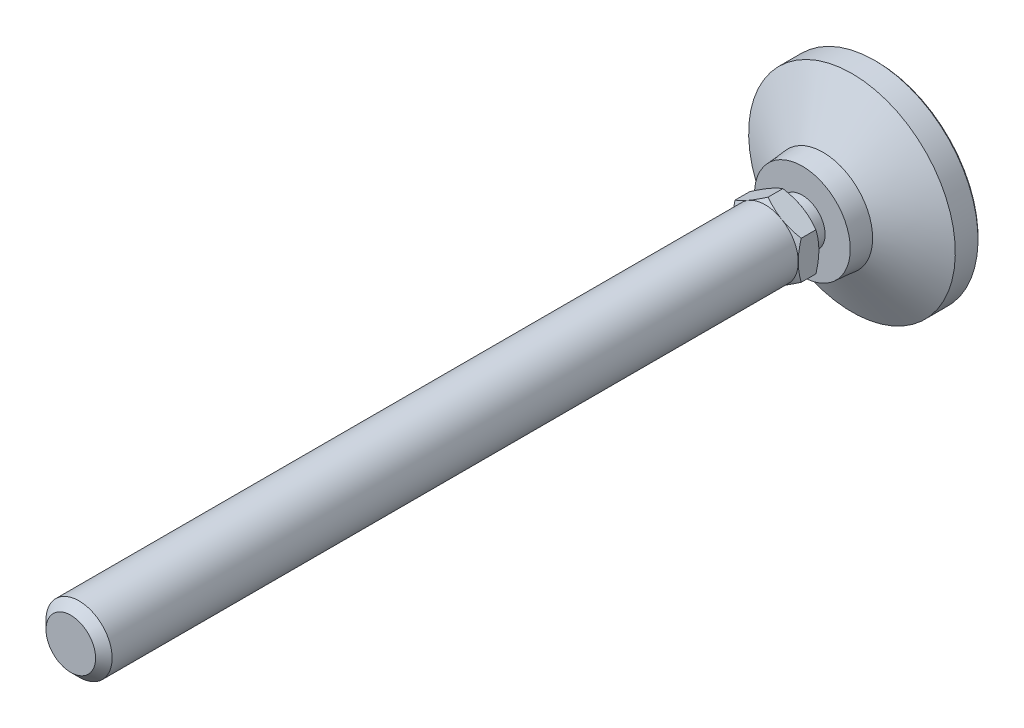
ISO-10303-21;
HEADER;
FILE_DESCRIPTION(('STEP AP214'),'2;1');
FILE_NAME('part.step','',(''),(''),'','','');
FILE_SCHEMA(('AUTOMOTIVE_DESIGN { 1 0 10303 214 1 1 1 1 }'));
ENDSEC;
DATA;
#1=APPLICATION_CONTEXT('core data for automotive mechanical design processes');
#2=APPLICATION_PROTOCOL_DEFINITION('international standard','automotive_design',2000,#1);
#3=PRODUCT_CONTEXT('',#1,'mechanical');
#4=PRODUCT('Part','Part','',(#3));
#5=PRODUCT_RELATED_PRODUCT_CATEGORY('part','',(#4));
#6=PRODUCT_DEFINITION_FORMATION('','',#4);
#7=PRODUCT_DEFINITION_CONTEXT('part definition',#1,'design');
#8=PRODUCT_DEFINITION('design','',#6,#7);
#9=PRODUCT_DEFINITION_SHAPE('','',#8);
#10=(LENGTH_UNIT() NAMED_UNIT(*) SI_UNIT(.MILLI.,.METRE.));
#11=(NAMED_UNIT(*) PLANE_ANGLE_UNIT() SI_UNIT($,.RADIAN.));
#12=(NAMED_UNIT(*) SI_UNIT($,.STERADIAN.) SOLID_ANGLE_UNIT());
#13=UNCERTAINTY_MEASURE_WITH_UNIT(LENGTH_MEASURE(1.E-05),#10,'distance_accuracy_value','');
#14=(GEOMETRIC_REPRESENTATION_CONTEXT(3) GLOBAL_UNCERTAINTY_ASSIGNED_CONTEXT((#13)) GLOBAL_UNIT_ASSIGNED_CONTEXT((#10,
#11,#12)) REPRESENTATION_CONTEXT('',''));
#15=CARTESIAN_POINT('',(0.,0.,0.));
#16=DIRECTION('',(0.,0.,1.));
#17=DIRECTION('',(1.,0.,0.));
#18=AXIS2_PLACEMENT_3D('',#15,#16,#17);
#19=CARTESIAN_POINT('',(0.,-5.50000000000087,21.9999999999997));
#20=DIRECTION('',(0.,0.,-1.));
#21=DIRECTION('',(0.,1.,0.));
#22=AXIS2_PLACEMENT_3D('',#19,#20,#21);
#23=PLANE('',#22);
#24=CARTESIAN_POINT('',(0.,0.,21.9999999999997));
#25=DIRECTION('',(0.,0.,-1.));
#26=DIRECTION('',(0.,1.,0.));
#27=AXIS2_PLACEMENT_3D('',#24,#25,#26);
#28=CIRCLE('',#27,8.00000000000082);
#29=CARTESIAN_POINT('',(-4.00000000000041,6.92820323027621,21.9999999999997));
#30=VERTEX_POINT('',#29);
#31=CARTESIAN_POINT('',(-8.00000000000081,0.,21.9999999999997));
#32=VERTEX_POINT('',#31);
#33=EDGE_CURVE('E9',#30,#32,#28,.F.);
#34=ORIENTED_EDGE('',*,*,#33,.F.);
#35=CARTESIAN_POINT('',(4.,6.92820323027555,21.9999999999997));
#36=VERTEX_POINT('',#35);
#37=EDGE_CURVE('E18',#36,#30,#28,.F.);
#38=ORIENTED_EDGE('',*,*,#37,.F.);
#39=CARTESIAN_POINT('',(8.00000000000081,0.,21.9999999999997));
#40=VERTEX_POINT('',#39);
#41=EDGE_CURVE('E125',#40,#36,#28,.F.);
#42=ORIENTED_EDGE('',*,*,#41,.F.);
#43=CARTESIAN_POINT('',(0.,0.,21.9999999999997));
#44=DIRECTION('',(0.,0.,1.));
#45=DIRECTION('',(0.,-1.,0.));
#46=AXIS2_PLACEMENT_3D('',#43,#44,#45);
#47=CIRCLE('',#46,8.00000000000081);
#48=CARTESIAN_POINT('',(4.00000000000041,-6.92820323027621,21.9999999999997));
#49=VERTEX_POINT('',#48);
#50=EDGE_CURVE('E572',#49,#40,#47,.T.);
#51=ORIENTED_EDGE('',*,*,#50,.F.);
#52=CARTESIAN_POINT('',(-4.00000000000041,-6.92820323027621,21.9999999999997));
#53=VERTEX_POINT('',#52);
#54=EDGE_CURVE('E574',#53,#49,#28,.F.);
#55=ORIENTED_EDGE('',*,*,#54,.F.);
#56=EDGE_CURVE('E23',#32,#53,#28,.F.);
#57=ORIENTED_EDGE('',*,*,#56,.F.);
#58=EDGE_LOOP('',(#34,#38,#42,#51,#55,#57));
#59=FACE_BOUND('',#58,.T.);
#60=CARTESIAN_POINT('',(0.,0.,21.9999999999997));
#61=DIRECTION('',(0.,0.,-1.));
#62=DIRECTION('',(0.,1.,0.));
#63=AXIS2_PLACEMENT_3D('',#60,#61,#62);
#64=CIRCLE('',#63,5.50000000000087);
#65=CARTESIAN_POINT('',(0.,5.50000000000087,21.9999999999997));
#66=VERTEX_POINT('',#65);
#67=EDGE_CURVE('E232',#66,#66,#64,.T.);
#68=ORIENTED_EDGE('',*,*,#67,.F.);
#69=EDGE_LOOP('',(#68));
#70=FACE_BOUND('',#69,.T.);
#71=ADVANCED_FACE('F14',(#59,#70),#23,.T.);
#72=CARTESIAN_POINT('',(0.,0.,-1.));
#73=DIRECTION('',(0.,0.,-1.));
#74=DIRECTION('',(0.,1.,0.));
#75=AXIS2_PLACEMENT_3D('',#72,#73,#74);
#76=CYLINDRICAL_SURFACE('',#75,5.50000000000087);
#77=CARTESIAN_POINT('',(0.,0.,18.));
#78=DIRECTION('',(0.,0.,-1.));
#79=DIRECTION('',(0.,1.,0.));
#80=AXIS2_PLACEMENT_3D('',#77,#78,#79);
#81=CIRCLE('',#80,5.50000000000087);
#82=CARTESIAN_POINT('',(0.,5.50000000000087,18.));
#83=VERTEX_POINT('',#82);
#84=EDGE_CURVE('E235',#83,#83,#81,.T.);
#85=ORIENTED_EDGE('',*,*,#84,.F.);
#86=EDGE_LOOP('',(#85));
#87=FACE_BOUND('',#86,.T.);
#88=ORIENTED_EDGE('',*,*,#67,.T.);
#89=EDGE_LOOP('',(#88));
#90=FACE_BOUND('',#89,.T.);
#91=ADVANCED_FACE('F289',(#87,#90),#76,.T.);
#92=CARTESIAN_POINT('',(0.,-5.50000000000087,18.));
#93=DIRECTION('',(0.,0.,1.));
#94=DIRECTION('',(0.,-1.,0.));
#95=AXIS2_PLACEMENT_3D('',#92,#93,#94);
#96=PLANE('',#95);
#97=ORIENTED_EDGE('',*,*,#84,.T.);
#98=EDGE_LOOP('',(#97));
#99=FACE_BOUND('',#98,.T.);
#100=CARTESIAN_POINT('',(0.,0.,18.));
#101=DIRECTION('',(0.,0.,1.));
#102=DIRECTION('',(0.,-1.,0.));
#103=AXIS2_PLACEMENT_3D('',#100,#101,#102);
#104=CIRCLE('',#103,11.5833333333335);
#105=CARTESIAN_POINT('',(0.,-11.5833333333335,18.));
#106=VERTEX_POINT('',#105);
#107=EDGE_CURVE('E238',#106,#106,#104,.T.);
#108=ORIENTED_EDGE('',*,*,#107,.T.);
#109=EDGE_LOOP('',(#108));
#110=FACE_BOUND('',#109,.T.);
#111=ADVANCED_FACE('F281',(#99,#110),#96,.T.);
#112=CARTESIAN_POINT('',(0.,0.,0.));
#113=DIRECTION('',(0.,0.,-1.));
#114=DIRECTION('',(0.,1.,0.));
#115=AXIS2_PLACEMENT_3D('',#112,#113,#114);
#116=PLANE('',#115);
#117=CARTESIAN_POINT('',(0.,0.,0.));
#118=DIRECTION('',(0.,0.,-1.));
#119=DIRECTION('',(0.,1.,0.));
#120=AXIS2_PLACEMENT_3D('',#117,#118,#119);
#121=CIRCLE('',#120,24.5);
#122=CARTESIAN_POINT('',(0.,24.5,0.));
#123=VERTEX_POINT('',#122);
#124=EDGE_CURVE('E267',#123,#123,#121,.T.);
#125=ORIENTED_EDGE('',*,*,#124,.T.);
#126=EDGE_LOOP('',(#125));
#127=FACE_BOUND('',#126,.T.);
#128=ADVANCED_FACE('F199',(#127),#116,.T.);
#129=CARTESIAN_POINT('',(0.,0.,-1.));
#130=DIRECTION('',(0.,0.,-1.));
#131=DIRECTION('',(0.,1.,0.));
#132=AXIS2_PLACEMENT_3D('',#129,#130,#131);
#133=CYLINDRICAL_SURFACE('',#132,25.);
#134=CARTESIAN_POINT('',(0.,0.,0.500000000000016));
#135=DIRECTION('',(0.,0.,-1.));
#136=DIRECTION('',(0.,1.,0.));
#137=AXIS2_PLACEMENT_3D('',#134,#135,#136);
#138=CIRCLE('',#137,25.);
#139=CARTESIAN_POINT('',(0.,25.,0.500000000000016));
#140=VERTEX_POINT('',#139);
#141=EDGE_CURVE('E126',#140,#140,#138,.F.);
#142=ORIENTED_EDGE('',*,*,#141,.T.);
#143=EDGE_LOOP('',(#142));
#144=FACE_BOUND('',#143,.T.);
#145=CARTESIAN_POINT('',(0.,0.,5.9999999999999));
#146=DIRECTION('',(0.,0.,-1.));
#147=DIRECTION('',(0.,1.,0.));
#148=AXIS2_PLACEMENT_3D('',#145,#146,#147);
#149=CIRCLE('',#148,25.);
#150=CARTESIAN_POINT('',(0.,25.,5.9999999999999));
#151=VERTEX_POINT('',#150);
#152=EDGE_CURVE('E241',#151,#151,#149,.T.);
#153=ORIENTED_EDGE('',*,*,#152,.T.);
#154=EDGE_LOOP('',(#153));
#155=FACE_BOUND('',#154,.T.);
#156=ADVANCED_FACE('F272',(#144,#155),#133,.T.);
#157=CARTESIAN_POINT('',(0.,0.,13.));
#158=DIRECTION('',(0.,0.,-1.));
#159=DIRECTION('',(0.,1.,0.));
#160=AXIS2_PLACEMENT_3D('',#157,#158,#159);
#161=CONICAL_SURFACE('',#160,12.0000000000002,1.07685495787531);
#162=ORIENTED_EDGE('',*,*,#152,.F.);
#163=EDGE_LOOP('',(#162));
#164=FACE_BOUND('',#163,.T.);
#165=CARTESIAN_POINT('',(0.,0.,13.));
#166=DIRECTION('',(0.,0.,-1.));
#167=DIRECTION('',(0.,1.,0.));
#168=AXIS2_PLACEMENT_3D('',#165,#166,#167);
#169=CIRCLE('',#168,12.0000000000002);
#170=CARTESIAN_POINT('',(0.,12.0000000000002,13.));
#171=VERTEX_POINT('',#170);
#172=EDGE_CURVE('E257',#171,#171,#169,.T.);
#173=ORIENTED_EDGE('',*,*,#172,.T.);
#174=EDGE_LOOP('',(#173));
#175=FACE_BOUND('',#174,.T.);
#176=ADVANCED_FACE('F288',(#164,#175),#161,.T.);
#177=CARTESIAN_POINT('',(0.,0.,19.));
#178=DIRECTION('',(0.,0.,-1.));
#179=DIRECTION('',(0.,1.,0.));
#180=AXIS2_PLACEMENT_3D('',#177,#178,#179);
#181=CONICAL_SURFACE('',#180,11.5000000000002,0.0831412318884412);
#182=ORIENTED_EDGE('',*,*,#172,.F.);
#183=EDGE_LOOP('',(#182));
#184=FACE_BOUND('',#183,.T.);
#185=ORIENTED_EDGE('',*,*,#107,.F.);
#186=EDGE_LOOP('',(#185));
#187=FACE_BOUND('',#186,.T.);
#188=ADVANCED_FACE('F277',(#184,#187),#181,.T.);
#189=CARTESIAN_POINT('',(0.,0.,0.));
#190=DIRECTION('',(0.,0.,1.));
#191=DIRECTION('',(0.,-1.,0.));
#192=AXIS2_PLACEMENT_3D('',#189,#190,#191);
#193=CONICAL_SURFACE('',#192,24.5,0.785398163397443);
#194=ORIENTED_EDGE('',*,*,#141,.F.);
#195=EDGE_LOOP('',(#194));
#196=FACE_BOUND('',#195,.T.);
#197=ORIENTED_EDGE('',*,*,#124,.F.);
#198=EDGE_LOOP('',(#197));
#199=FACE_BOUND('',#198,.T.);
#200=ADVANCED_FACE('F16',(#196,#199),#193,.T.);
#201=CARTESIAN_POINT('',(0.,0.,21.9999999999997));
#202=DIRECTION('',(0.,0.,1.));
#203=DIRECTION('',(0.,-1.,0.));
#204=AXIS2_PLACEMENT_3D('',#201,#202,#203);
#205=CONICAL_SURFACE('',#204,8.00000000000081,1.0471975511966);
#206=CARTESIAN_POINT('',(-8.0002,4.61868668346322,22.7145978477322));
#207=CARTESIAN_POINT('',(-7.8243512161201,4.72021302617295,22.6559907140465));
#208=CARTESIAN_POINT('',(-7.64784680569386,4.8221178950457,22.6000434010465));
#209=CARTESIAN_POINT('',(-7.29340453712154,5.02675523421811,22.4942010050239));
#210=CARTESIAN_POINT('',(-7.11546609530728,5.12948804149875,22.4443085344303));
#211=CARTESIAN_POINT('',(-6.57880176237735,5.43933133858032,22.3046927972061));
#212=CARTESIAN_POINT('',(-6.21795741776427,5.64766491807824,22.2252811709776));
#213=CARTESIAN_POINT('',(-5.67796082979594,5.95943209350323,22.1321616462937));
#214=CARTESIAN_POINT('',(-5.50042181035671,6.06193429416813,22.1056345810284));
#215=CARTESIAN_POINT('',(-5.14454088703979,6.26740224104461,22.0611531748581));
#216=CARTESIAN_POINT('',(-4.96619905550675,6.37036794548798,22.0431980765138));
#217=CARTESIAN_POINT('',(-4.6092083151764,6.57647664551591,22.0163156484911));
#218=CARTESIAN_POINT('',(-4.43055998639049,6.67961930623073,22.0073780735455));
#219=CARTESIAN_POINT('',(-4.07309829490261,6.88599991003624,21.9987223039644));
#220=CARTESIAN_POINT('',(-3.89428493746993,6.9892378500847,21.9990038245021));
#221=CARTESIAN_POINT('',(-3.55998663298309,7.18224506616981,22.008145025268));
#222=CARTESIAN_POINT('',(-3.40447809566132,7.27202796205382,22.0158896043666));
#223=CARTESIAN_POINT('',(-3.09382523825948,7.45138347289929,22.0382011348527));
#224=CARTESIAN_POINT('',(-2.93868094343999,7.54095607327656,22.0527685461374));
#225=CARTESIAN_POINT('',(-2.47384868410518,7.80932710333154,22.1063606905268));
#226=CARTESIAN_POINT('',(-2.16498351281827,7.98765049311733,22.1552686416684));
#227=CARTESIAN_POINT('',(-1.54397677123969,8.3461889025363,22.2775394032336));
#228=CARTESIAN_POINT('',(-1.23191445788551,8.52635816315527,22.3514205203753));
#229=CARTESIAN_POINT('',(-0.61244351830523,8.8840098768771,22.5191001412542));
#230=CARTESIAN_POINT('',(-0.305026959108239,9.06149691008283,22.6128592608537));
#231=CARTESIAN_POINT('',(0.000200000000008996,9.23771977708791,22.7145978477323));
#232=B_SPLINE_CURVE_WITH_KNOTS('',3,(#206,#207,#208,#209,#210,#211,#212,#213,#214,#215,#216,
#217,#218,#219,#220,#221,#222,#223,#224,#225,#226,#227,#228,#229,#230,#231),.UNSPECIFIED.,.F.,
.F.,(4,2,2,2,2,2,2,2,2,2,2,2,4),(0.,0.633973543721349,1.26821965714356,2.53934712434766,
3.15934343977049,3.77928496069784,4.39852133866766,5.01773858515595,5.55680239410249,
6.09590254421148,7.17487077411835,8.27776850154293,9.37850115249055),.UNSPECIFIED.);
#233=CARTESIAN_POINT('',(0.,9.23760430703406,22.7145311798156));
#234=VERTEX_POINT('',#233);
#235=EDGE_CURVE('E115',#30,#234,#232,.T.);
#236=ORIENTED_EDGE('',*,*,#235,.T.);
#237=CARTESIAN_POINT('',(-0.000199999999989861,9.2377197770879,22.7145978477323));
#238=CARTESIAN_POINT('',(0.175648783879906,9.13619343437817,22.6559907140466));
#239=CARTESIAN_POINT('',(0.352153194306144,9.03428856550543,22.6000434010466));
#240=CARTESIAN_POINT('',(0.70659546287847,8.82965122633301,22.4942010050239));
#241=CARTESIAN_POINT('',(0.884533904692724,8.72691841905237,22.4443085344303));
#242=CARTESIAN_POINT('',(1.42119823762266,8.4170751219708,22.3046927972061));
#243=CARTESIAN_POINT('',(1.78204258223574,8.20874154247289,22.2252811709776));
#244=CARTESIAN_POINT('',(2.32203917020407,7.89697436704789,22.1321616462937));
#245=CARTESIAN_POINT('',(2.49957818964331,7.79447216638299,22.1056345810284));
#246=CARTESIAN_POINT('',(2.85545911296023,7.58900421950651,22.0611531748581));
#247=CARTESIAN_POINT('',(3.03380094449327,7.48603851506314,22.0431980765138));
#248=CARTESIAN_POINT('',(3.39079168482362,7.27992981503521,22.0163156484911));
#249=CARTESIAN_POINT('',(3.56944001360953,7.17678715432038,22.0073780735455));
#250=CARTESIAN_POINT('',(3.92690170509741,6.97040655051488,21.9987223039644));
#251=CARTESIAN_POINT('',(4.1057150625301,6.86716861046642,21.9990038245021));
#252=CARTESIAN_POINT('',(4.44001336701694,6.67416139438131,22.008145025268));
#253=CARTESIAN_POINT('',(4.5955219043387,6.5843784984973,22.0158896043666));
#254=CARTESIAN_POINT('',(4.90617476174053,6.40502298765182,22.0382011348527));
#255=CARTESIAN_POINT('',(5.06131905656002,6.31545038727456,22.0527685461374));
#256=CARTESIAN_POINT('',(5.52615131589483,6.04707935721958,22.1063606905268));
#257=CARTESIAN_POINT('',(5.83501648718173,5.86875596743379,22.1552686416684));
#258=CARTESIAN_POINT('',(6.4560232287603,5.51021755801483,22.2775394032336));
#259=CARTESIAN_POINT('',(6.76808554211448,5.33004829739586,22.3514205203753));
#260=CARTESIAN_POINT('',(7.38755648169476,4.97239658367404,22.5191001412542));
#261=CARTESIAN_POINT('',(7.69497304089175,4.79490955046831,22.6128592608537));
#262=CARTESIAN_POINT('',(8.0002,4.61868668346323,22.7145978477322));
#263=B_SPLINE_CURVE_WITH_KNOTS('',3,(#237,#238,#239,#240,#241,#242,#243,#244,#245,#246,#247,
#248,#249,#250,#251,#252,#253,#254,#255,#256,#257,#258,#259,#260,#261,#262),.UNSPECIFIED.,.F.,
.F.,(4,2,2,2,2,2,2,2,2,2,2,2,4),(0.,0.633973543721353,1.26821965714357,2.53934712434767,
3.15934343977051,3.77928496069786,4.39852133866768,5.01773858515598,5.55680239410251,
6.09590254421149,7.17487077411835,8.27776850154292,9.37850115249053),.UNSPECIFIED.);
#264=EDGE_CURVE('E121',#234,#36,#263,.T.);
#265=ORIENTED_EDGE('',*,*,#264,.T.);
#266=ORIENTED_EDGE('',*,*,#37,.T.);
#267=EDGE_LOOP('',(#236,#265,#266));
#268=FACE_BOUND('',#267,.T.);
#269=ADVANCED_FACE('F119',(#268),#205,.T.);
#270=CARTESIAN_POINT('',(8.,12.3639470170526,25.8834952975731));
#271=CARTESIAN_POINT('',(8.,12.0148961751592,25.7143465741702));
#272=CARTESIAN_POINT('',(8.,11.6650394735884,25.5468321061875));
#273=CARTESIAN_POINT('',(8.,10.9632856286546,25.215991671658));
#274=CARTESIAN_POINT('',(8.,10.6113881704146,25.0526663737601));
#275=CARTESIAN_POINT('',(8.,9.90329036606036,24.7302933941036));
#276=CARTESIAN_POINT('',(8.,9.54707699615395,24.5712742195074));
#277=CARTESIAN_POINT('',(8.,8.83180218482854,24.2598006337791));
#278=CARTESIAN_POINT('',(8.,8.47274088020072,24.1073459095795));
#279=CARTESIAN_POINT('',(8.,7.73976293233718,23.8060347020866));
#280=CARTESIAN_POINT('',(8.,7.36573596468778,23.6574451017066));
#281=CARTESIAN_POINT('',(8.,6.61329128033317,23.3716154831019));
#282=CARTESIAN_POINT('',(8.,6.23487307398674,23.2343767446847));
#283=CARTESIAN_POINT('',(8.,5.4737615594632,22.9748835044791));
#284=CARTESIAN_POINT('',(8.,5.09107883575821,22.8525982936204));
#285=CARTESIAN_POINT('',(8.,4.32023813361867,22.6269625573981));
#286=CARTESIAN_POINT('',(8.,3.93208193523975,22.5236060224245));
#287=CARTESIAN_POINT('',(8.,3.15216180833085,22.3413718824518));
#288=CARTESIAN_POINT('',(8.,2.76042946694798,22.2623627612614));
#289=CARTESIAN_POINT('',(8.,2.1692980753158,22.1655500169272));
#290=CARTESIAN_POINT('',(8.,1.97165058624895,22.1368945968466));
#291=CARTESIAN_POINT('',(8.,1.57538779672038,22.0873804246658));
#292=CARTESIAN_POINT('',(8.,1.37677259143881,22.0665209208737));
#293=CARTESIAN_POINT('',(8.,0.981415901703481,22.0332735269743));
#294=CARTESIAN_POINT('',(8.,0.784683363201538,22.0207796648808));
#295=CARTESIAN_POINT('',(8.,0.390866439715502,22.004119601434));
#296=CARTESIAN_POINT('',(8.,0.193782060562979,21.9999532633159));
#297=CARTESIAN_POINT('',(8.,-0.200386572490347,22.0000475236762));
#298=CARTESIAN_POINT('',(8.,-0.397470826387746,22.0043081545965));
#299=CARTESIAN_POINT('',(8.,-0.7912858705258,22.0211529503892));
#300=CARTESIAN_POINT('',(8.,-0.988016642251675,22.0337375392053));
#301=CARTESIAN_POINT('',(8.,-1.46213553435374,22.0738319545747));
#302=CARTESIAN_POINT('',(8.,-1.73919053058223,22.1053642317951));
#303=CARTESIAN_POINT('',(8.,-2.29120289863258,22.1832071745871));
#304=CARTESIAN_POINT('',(8.,-2.5661599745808,22.2295198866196));
#305=CARTESIAN_POINT('',(8.,-3.38759406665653,22.3881693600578));
#306=CARTESIAN_POINT('',(8.,-3.93031791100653,22.5201872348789));
#307=CARTESIAN_POINT('',(8.,-4.74175348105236,22.7485926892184));
#308=CARTESIAN_POINT('',(8.,-5.01468767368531,22.830837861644));
#309=CARTESIAN_POINT('',(8.,-5.55790437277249,23.0037407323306));
#310=CARTESIAN_POINT('',(8.,-5.82818686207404,23.0943984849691));
#311=CARTESIAN_POINT('',(8.,-6.36618744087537,23.2826828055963));
#312=CARTESIAN_POINT('',(8.,-6.6339063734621,23.3803069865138));
#313=CARTESIAN_POINT('',(8.,-7.16713516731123,23.5813885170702));
#314=CARTESIAN_POINT('',(8.,-7.43264505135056,23.6848458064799));
#315=CARTESIAN_POINT('',(8.,-8.04619163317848,23.930443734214));
#316=CARTESIAN_POINT('',(8.,-8.39350535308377,24.0743868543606));
#317=CARTESIAN_POINT('',(8.,-9.08527953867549,24.3689922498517));
#318=CARTESIAN_POINT('',(8.,-9.42973984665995,24.5196548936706));
#319=CARTESIAN_POINT('',(8.,-10.1163142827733,24.8263872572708));
#320=CARTESIAN_POINT('',(8.,-10.4584279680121,24.9824579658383));
#321=CARTESIAN_POINT('',(8.,-11.1406383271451,25.2989547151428));
#322=CARTESIAN_POINT('',(8.,-11.4807349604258,25.4593808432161));
#323=CARTESIAN_POINT('',(8.,-12.1595644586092,25.7839508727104));
#324=CARTESIAN_POINT('',(8.,-12.4982956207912,25.9480983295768));
#325=CARTESIAN_POINT('',(8.,-13.1743160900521,26.2793385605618));
#326=CARTESIAN_POINT('',(8.,-13.5116053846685,26.4464313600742));
#327=CARTESIAN_POINT('',(8.,-14.5215639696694,26.9513223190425));
#328=CARTESIAN_POINT('',(8.,-15.1924071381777,27.292773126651));
#329=CARTESIAN_POINT('',(8.,-16.4765214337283,27.9547420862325));
#330=CARTESIAN_POINT('',(8.,-17.0900694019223,28.2747255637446));
#331=CARTESIAN_POINT('',(8.,-18.3148619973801,28.919115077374));
#332=CARTESIAN_POINT('',(8.,-18.9261065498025,29.243521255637));
#333=CARTESIAN_POINT('',(8.,-20.1453524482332,29.8949481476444));
#334=CARTESIAN_POINT('',(8.,-20.7533580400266,30.2219609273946));
#335=CARTESIAN_POINT('',(8.,-21.9678882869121,30.8786509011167));
#336=CARTESIAN_POINT('',(8.,-22.574413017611,31.2083279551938));
#337=CARTESIAN_POINT('',(8.,-23.1803888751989,31.539004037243));
#338=B_SPLINE_CURVE_WITH_KNOTS('',3,(#270,#271,#272,#273,#274,#275,#276,#277,#278,#279,#280,
#281,#282,#283,#284,#285,#286,#287,#288,#289,#290,#291,#292,#293,#294,#295,#296,#297,#298,#299,
#300,#301,#302,#303,#304,#305,#306,#307,#308,#309,#310,#311,#312,#313,#314,#315,#316,#317,#318,
#319,#320,#321,#322,#323,#324,#325,#326,#327,#328,#329,#330,#331,#332,#333,#334,#335,#336,#337),
.UNSPECIFIED.,.F.,.F.,(4,2,2,2,2,2,2,2,2,2,2,2,2,2,2,2,2,2,2,2,2,2,2,2,2,2,2,2,2,2,2,2,2,4),(0.,
1.1636423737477,2.32746933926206,3.49770495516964,4.66788469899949,5.87512546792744,
7.08250216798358,8.287356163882,9.49182696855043,10.6896727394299,11.2886850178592,
11.8876395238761,12.4788554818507,13.0700617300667,13.6612702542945,14.2525088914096,
15.0885663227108,15.9247395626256,17.5980342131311,18.4531347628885,19.3082408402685,
20.1630553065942,21.0178609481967,22.1456492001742,23.2734993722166,24.4015568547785,
25.5296369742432,26.6588445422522,27.7880618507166,30.0462194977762,32.1221276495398,
34.1981026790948,36.2692000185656,38.3401893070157),.UNSPECIFIED.);
#339=CARTESIAN_POINT('',(8.,4.61880215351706,22.7145311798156));
#340=VERTEX_POINT('',#339);
#341=EDGE_CURVE('E134',#340,#40,#338,.T.);
#342=ORIENTED_EDGE('',*,*,#341,.T.);
#343=ORIENTED_EDGE('',*,*,#41,.T.);
#344=EDGE_CURVE('E171',#36,#340,#263,.T.);
#345=ORIENTED_EDGE('',*,*,#344,.T.);
#346=EDGE_LOOP('',(#342,#343,#345));
#347=FACE_BOUND('',#346,.T.);
#348=ADVANCED_FACE('F159',(#347),#205,.T.);
#349=CARTESIAN_POINT('',(8.0002,-4.61868668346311,22.7145978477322));
#350=CARTESIAN_POINT('',(7.82435121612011,-4.72021302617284,22.6559907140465));
#351=CARTESIAN_POINT('',(7.64784680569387,-4.82211789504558,22.6000434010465));
#352=CARTESIAN_POINT('',(7.29340453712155,-5.02675523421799,22.4942010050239));
#353=CARTESIAN_POINT('',(7.11546609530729,-5.12948804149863,22.4443085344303));
#354=CARTESIAN_POINT('',(6.57880176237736,-5.4393313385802,22.3046927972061));
#355=CARTESIAN_POINT('',(6.21795741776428,-5.64766491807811,22.2252811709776));
#356=CARTESIAN_POINT('',(5.67796082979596,-5.95943209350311,22.1321616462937));
#357=CARTESIAN_POINT('',(5.50042181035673,-6.06193429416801,22.1056345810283));
#358=CARTESIAN_POINT('',(5.14454088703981,-6.26740224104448,22.0611531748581));
#359=CARTESIAN_POINT('',(4.96619905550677,-6.37036794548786,22.0431980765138));
#360=CARTESIAN_POINT('',(4.60920831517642,-6.57647664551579,22.0163156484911));
#361=CARTESIAN_POINT('',(4.43055998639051,-6.67961930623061,22.0073780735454));
#362=CARTESIAN_POINT('',(4.07309829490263,-6.88599991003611,21.9987223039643));
#363=CARTESIAN_POINT('',(3.89428493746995,-6.98923785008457,21.999003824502));
#364=CARTESIAN_POINT('',(3.55998663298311,-7.18224506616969,22.008145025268));
#365=CARTESIAN_POINT('',(3.40447809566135,-7.27202796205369,22.0158896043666));
#366=CARTESIAN_POINT('',(3.09382523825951,-7.45138347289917,22.0382011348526));
#367=CARTESIAN_POINT('',(2.93868094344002,-7.54095607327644,22.0527685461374));
#368=CARTESIAN_POINT('',(2.4738486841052,-7.80932710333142,22.1063606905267));
#369=CARTESIAN_POINT('',(2.16498351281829,-7.98765049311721,22.1552686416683));
#370=CARTESIAN_POINT('',(1.54397677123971,-8.34618890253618,22.2775394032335));
#371=CARTESIAN_POINT('',(1.23191445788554,-8.52635816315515,22.3514205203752));
#372=CARTESIAN_POINT('',(0.612443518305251,-8.88400987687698,22.5191001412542));
#373=CARTESIAN_POINT('',(0.305026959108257,-9.06149691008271,22.6128592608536));
#374=CARTESIAN_POINT('',(-0.000199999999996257,-9.23771977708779,22.7145978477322));
#375=B_SPLINE_CURVE_WITH_KNOTS('',3,(#349,#350,#351,#352,#353,#354,#355,#356,#357,#358,#359,
#360,#361,#362,#363,#364,#365,#366,#367,#368,#369,#370,#371,#372,#373,#374),.UNSPECIFIED.,.F.,
.F.,(4,2,2,2,2,2,2,2,2,2,2,2,4),(0.,0.63397354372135,1.26821965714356,2.53934712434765,
3.15934343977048,3.77928496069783,4.39852133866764,5.01773858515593,5.55680239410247,
6.09590254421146,7.17487077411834,8.27776850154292,9.37850115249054),.UNSPECIFIED.);
#376=CARTESIAN_POINT('',(8.,-4.61880215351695,22.7145311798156));
#377=VERTEX_POINT('',#376);
#378=EDGE_CURVE('E149',#377,#49,#375,.T.);
#379=ORIENTED_EDGE('',*,*,#378,.T.);
#380=ORIENTED_EDGE('',*,*,#50,.T.);
#381=EDGE_CURVE('E114',#40,#377,#338,.T.);
#382=ORIENTED_EDGE('',*,*,#381,.T.);
#383=EDGE_LOOP('',(#379,#380,#382));
#384=FACE_BOUND('',#383,.T.);
#385=ADVANCED_FACE('F163',(#384),#205,.T.);
#386=CARTESIAN_POINT('',(0.00020000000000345,-9.23771977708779,22.7145978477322));
#387=CARTESIAN_POINT('',(-0.175648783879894,-9.13619343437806,22.6559907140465));
#388=CARTESIAN_POINT('',(-0.352153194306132,-9.03428856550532,22.6000434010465));
#389=CARTESIAN_POINT('',(-0.706595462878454,-8.8296512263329,22.4942010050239));
#390=CARTESIAN_POINT('',(-0.884533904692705,-8.72691841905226,22.4443085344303));
#391=CARTESIAN_POINT('',(-1.42119823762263,-8.4170751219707,22.3046927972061));
#392=CARTESIAN_POINT('',(-1.78204258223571,-8.20874154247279,22.2252811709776));
#393=CARTESIAN_POINT('',(-2.32203917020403,-7.8969743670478,22.1321616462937));
#394=CARTESIAN_POINT('',(-2.49957818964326,-7.79447216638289,22.1056345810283));
#395=CARTESIAN_POINT('',(-2.85545911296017,-7.58900421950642,22.0611531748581));
#396=CARTESIAN_POINT('',(-3.03380094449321,-7.48603851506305,22.0431980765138));
#397=CARTESIAN_POINT('',(-3.39079168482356,-7.27992981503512,22.0163156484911));
#398=CARTESIAN_POINT('',(-3.56944001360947,-7.1767871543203,22.0073780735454));
#399=CARTESIAN_POINT('',(-3.92690170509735,-6.97040655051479,21.9987223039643));
#400=CARTESIAN_POINT('',(-4.10571506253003,-6.86716861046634,21.999003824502));
#401=CARTESIAN_POINT('',(-4.44001336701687,-6.67416139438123,22.008145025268));
#402=CARTESIAN_POINT('',(-4.59552190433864,-6.58437849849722,22.0158896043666));
#403=CARTESIAN_POINT('',(-4.90617476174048,-6.40502298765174,22.0382011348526));
#404=CARTESIAN_POINT('',(-5.06131905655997,-6.31545038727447,22.0527685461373));
#405=CARTESIAN_POINT('',(-5.52615131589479,-6.04707935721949,22.1063606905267));
#406=CARTESIAN_POINT('',(-5.8350164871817,-5.86875596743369,22.1552686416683));
#407=CARTESIAN_POINT('',(-6.45602322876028,-5.51021755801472,22.2775394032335));
#408=CARTESIAN_POINT('',(-6.76808554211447,-5.33004829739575,22.3514205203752));
#409=CARTESIAN_POINT('',(-7.38755648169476,-4.97239658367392,22.5191001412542));
#410=CARTESIAN_POINT('',(-7.69497304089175,-4.79490955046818,22.6128592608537));
#411=CARTESIAN_POINT('',(-8.0002,-4.6186866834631,22.7145978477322));
#412=B_SPLINE_CURVE_WITH_KNOTS('',3,(#386,#387,#388,#389,#390,#391,#392,#393,#394,#395,#396,
#397,#398,#399,#400,#401,#402,#403,#404,#405,#406,#407,#408,#409,#410,#411),.UNSPECIFIED.,.F.,
.F.,(4,2,2,2,2,2,2,2,2,2,2,2,4),(0.,0.633973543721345,1.26821965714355,2.53934712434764,
3.15934343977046,3.7792849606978,4.39852133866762,5.01773858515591,5.55680239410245,
6.09590254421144,7.17487077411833,8.27776850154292,9.37850115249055),.UNSPECIFIED.);
#413=CARTESIAN_POINT('',(0.,-9.23760430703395,22.7145311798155));
#414=VERTEX_POINT('',#413);
#415=EDGE_CURVE('E37',#414,#53,#412,.T.);
#416=ORIENTED_EDGE('',*,*,#415,.T.);
#417=ORIENTED_EDGE('',*,*,#54,.T.);
#418=EDGE_CURVE('E516',#49,#414,#375,.T.);
#419=ORIENTED_EDGE('',*,*,#418,.T.);
#420=EDGE_LOOP('',(#416,#417,#419));
#421=FACE_BOUND('',#420,.T.);
#422=ADVANCED_FACE('F165',(#421),#205,.T.);
#423=CARTESIAN_POINT('',(-8.,-4.61880215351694,22.7145311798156));
#424=VERTEX_POINT('',#423);
#425=EDGE_CURVE('E186',#53,#424,#412,.T.);
#426=ORIENTED_EDGE('',*,*,#425,.T.);
#427=CARTESIAN_POINT('',(-8.,12.36394701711,25.883495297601));
#428=CARTESIAN_POINT('',(-8.,12.0148961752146,25.7143465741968));
#429=CARTESIAN_POINT('',(-8.00000000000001,11.6650394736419,25.5468321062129));
#430=CARTESIAN_POINT('',(-8.00000000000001,10.9632856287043,25.2159916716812));
#431=CARTESIAN_POINT('',(-8.00000000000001,10.6113881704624,25.0526663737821));
#432=CARTESIAN_POINT('',(-8.00000000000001,9.90329036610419,24.7302933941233));
#433=CARTESIAN_POINT('',(-8.00000000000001,9.54707699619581,24.5712742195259));
#434=CARTESIAN_POINT('',(-8.00000000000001,8.83180218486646,24.2598006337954));
#435=CARTESIAN_POINT('',(-8.00000000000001,8.47274088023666,24.1073459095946));
#436=CARTESIAN_POINT('',(-8.00000000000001,7.73976293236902,23.8060347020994));
#437=CARTESIAN_POINT('',(-8.00000000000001,7.3657359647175,23.6574451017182));
#438=CARTESIAN_POINT('',(-8.00000000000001,6.6132912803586,23.3716154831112));
#439=CARTESIAN_POINT('',(-8.,6.23487307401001,23.2343767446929));
#440=CARTESIAN_POINT('',(-8.,5.47376155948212,22.9748835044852));
#441=CARTESIAN_POINT('',(-8.00000000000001,5.09107883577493,22.8525982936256));
#442=CARTESIAN_POINT('',(-8.,4.32023813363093,22.6269625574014));
#443=CARTESIAN_POINT('',(-8.,3.93208193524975,22.523606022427));
#444=CARTESIAN_POINT('',(-8.,3.15216180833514,22.3413718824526));
#445=CARTESIAN_POINT('',(-8.,2.76042946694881,22.2623627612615));
#446=CARTESIAN_POINT('',(-8.,2.16929807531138,22.1655500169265));
#447=CARTESIAN_POINT('',(-8.,1.97165058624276,22.1368945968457));
#448=CARTESIAN_POINT('',(-8.,1.57538779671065,22.0873804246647));
#449=CARTESIAN_POINT('',(-8.,1.37677259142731,22.0665209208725));
#450=CARTESIAN_POINT('',(-8.,0.981415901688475,22.0332735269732));
#451=CARTESIAN_POINT('',(-8.,0.784683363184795,22.0207796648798));
#452=CARTESIAN_POINT('',(-8.,0.39086643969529,22.0041196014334));
#453=CARTESIAN_POINT('',(-8.,0.193782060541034,21.9999532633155));
#454=CARTESIAN_POINT('',(-8.,-0.200386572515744,22.0000475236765));
#455=CARTESIAN_POINT('',(-8.,-0.397470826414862,22.0043081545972));
#456=CARTESIAN_POINT('',(-8.,-0.791285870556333,22.0211529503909));
#457=CARTESIAN_POINT('',(-8.,-0.988016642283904,22.0337375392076));
#458=CARTESIAN_POINT('',(-8.,-1.46213553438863,22.0738319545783));
#459=CARTESIAN_POINT('',(-8.,-1.73919053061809,22.1053642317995));
#460=CARTESIAN_POINT('',(-8.,-2.29120289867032,22.1832071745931));
#461=CARTESIAN_POINT('',(-8.,-2.56615997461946,22.2295198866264));
#462=CARTESIAN_POINT('',(-8.,-3.38759406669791,22.3881693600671));
#463=CARTESIAN_POINT('',(-8.,-3.93031791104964,22.5201872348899));
#464=CARTESIAN_POINT('',(-8.,-4.74175348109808,22.7485926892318));
#465=CARTESIAN_POINT('',(-8.,-5.01468767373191,22.8308378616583));
#466=CARTESIAN_POINT('',(-8.,-5.55790437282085,23.0037407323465));
#467=CARTESIAN_POINT('',(-8.,-5.82818686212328,23.0943984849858));
#468=CARTESIAN_POINT('',(-8.,-6.36618744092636,23.2826828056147));
#469=CARTESIAN_POINT('',(-8.,-6.63390637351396,23.3803069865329));
#470=CARTESIAN_POINT('',(-8.,-7.16713516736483,23.5813885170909));
#471=CARTESIAN_POINT('',(-8.,-7.43264505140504,23.6848458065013));
#472=CARTESIAN_POINT('',(-8.,-8.04619163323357,23.9304437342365));
#473=CARTESIAN_POINT('',(-8.,-8.39350535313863,24.0743868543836));
#474=CARTESIAN_POINT('',(-8.,-9.08527953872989,24.3689922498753));
#475=CARTESIAN_POINT('',(-8.,-9.42973984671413,24.5196548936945));
#476=CARTESIAN_POINT('',(-8.,-10.1163142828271,24.8263872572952));
#477=CARTESIAN_POINT('',(-8.,-10.4584279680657,24.9824579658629));
#478=CARTESIAN_POINT('',(-8.,-11.1406383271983,25.2989547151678));
#479=CARTESIAN_POINT('',(-8.,-11.4807349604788,25.4593808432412));
#480=CARTESIAN_POINT('',(-8.,-12.1595644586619,25.7839508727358));
#481=CARTESIAN_POINT('',(-8.,-12.4982956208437,25.9480983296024));
#482=CARTESIAN_POINT('',(-8.,-13.1743160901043,26.2793385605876));
#483=CARTESIAN_POINT('',(-8.,-13.5116053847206,26.4464313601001));
#484=CARTESIAN_POINT('',(-8.,-14.521563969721,26.9513223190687));
#485=CARTESIAN_POINT('',(-8.,-15.1924071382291,27.2927731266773));
#486=CARTESIAN_POINT('',(-8.,-16.4765214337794,27.954742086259));
#487=CARTESIAN_POINT('',(-7.99999999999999,-17.0900694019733,28.2747255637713));
#488=CARTESIAN_POINT('',(-7.99999999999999,-18.3148619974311,28.919115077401));
#489=CARTESIAN_POINT('',(-7.99999999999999,-18.9261065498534,29.2435212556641));
#490=CARTESIAN_POINT('',(-7.99999999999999,-20.1453524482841,29.8949481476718));
#491=CARTESIAN_POINT('',(-7.99999999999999,-20.7533580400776,30.221960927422));
#492=CARTESIAN_POINT('',(-7.99999999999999,-21.9678882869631,30.8786509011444));
#493=CARTESIAN_POINT('',(-7.99999999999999,-22.574413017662,31.2083279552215));
#494=CARTESIAN_POINT('',(-8.,-23.1803888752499,31.5390040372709));
#495=B_SPLINE_CURVE_WITH_KNOTS('',3,(#427,#428,#429,#430,#431,#432,#433,#434,#435,#436,#437,
#438,#439,#440,#441,#442,#443,#444,#445,#446,#447,#448,#449,#450,#451,#452,#453,#454,#455,#456,
#457,#458,#459,#460,#461,#462,#463,#464,#465,#466,#467,#468,#469,#470,#471,#472,#473,#474,#475,
#476,#477,#478,#479,#480,#481,#482,#483,#484,#485,#486,#487,#488,#489,#490,#491,#492,#493,#494),
.UNSPECIFIED.,.F.,.F.,(4,2,2,2,2,2,2,2,2,2,2,2,2,2,2,2,2,2,2,2,2,2,2,2,2,2,2,2,2,2,2,2,2,4),(0.,
1.16364237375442,2.32746933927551,3.49770495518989,4.66788469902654,5.8751254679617,
7.08250216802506,8.28735616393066,9.49182696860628,10.6896727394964,11.288685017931,
11.8876395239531,12.4788554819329,13.0700617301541,13.6612702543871,14.2525088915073,
15.0885663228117,15.9247395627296,17.5980342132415,18.4531347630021,19.3082408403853,
20.1630553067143,21.0178609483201,22.1456492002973,23.2734993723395,24.4015568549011,
25.5296369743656,26.6588445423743,27.7880618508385,30.0462194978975,32.1221276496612,
34.1981026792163,36.2692000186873,38.3401893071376),.UNSPECIFIED.);
#496=EDGE_CURVE('E30',#424,#32,#495,.F.);
#497=ORIENTED_EDGE('',*,*,#496,.T.);
#498=ORIENTED_EDGE('',*,*,#56,.T.);
#499=EDGE_LOOP('',(#426,#497,#498));
#500=FACE_BOUND('',#499,.T.);
#501=ADVANCED_FACE('F382',(#500),#205,.T.);
#502=CARTESIAN_POINT('',(-8.,4.61880215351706,22.7145311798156));
#503=VERTEX_POINT('',#502);
#504=EDGE_CURVE('E109',#32,#503,#495,.F.);
#505=ORIENTED_EDGE('',*,*,#504,.T.);
#506=EDGE_CURVE('E103',#503,#30,#232,.T.);
#507=ORIENTED_EDGE('',*,*,#506,.T.);
#508=ORIENTED_EDGE('',*,*,#33,.T.);
#509=EDGE_LOOP('',(#505,#507,#508));
#510=FACE_BOUND('',#509,.T.);
#511=ADVANCED_FACE('F105',(#510),#205,.T.);
#512=CARTESIAN_POINT('',(0.,0.,195.));
#513=DIRECTION('',(0.,0.,-1.));
#514=DIRECTION('',(0.,1.,0.));
#515=AXIS2_PLACEMENT_3D('',#512,#513,#514);
#516=PLANE('',#515);
#517=CARTESIAN_POINT('',(0.,0.,195.));
#518=DIRECTION('',(0.,0.,-1.));
#519=DIRECTION('',(0.,1.,0.));
#520=AXIS2_PLACEMENT_3D('',#517,#518,#519);
#521=CIRCLE('',#520,6.00000000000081);
#522=CARTESIAN_POINT('',(0.,6.00000000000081,195.));
#523=VERTEX_POINT('',#522);
#524=EDGE_CURVE('E229',#523,#523,#521,.T.);
#525=ORIENTED_EDGE('',*,*,#524,.F.);
#526=EDGE_LOOP('',(#525));
#527=FACE_BOUND('',#526,.T.);
#528=ADVANCED_FACE('F300',(#527),#516,.F.);
#529=CARTESIAN_POINT('',(0.,0.,195.));
#530=DIRECTION('',(0.,0.,-1.));
#531=DIRECTION('',(0.,1.,0.));
#532=AXIS2_PLACEMENT_3D('',#529,#530,#531);
#533=CONICAL_SURFACE('',#532,6.00000000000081,0.785398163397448);
#534=CARTESIAN_POINT('',(0.,0.,193.));
#535=DIRECTION('',(0.,0.,-1.));
#536=DIRECTION('',(0.,1.,0.));
#537=AXIS2_PLACEMENT_3D('',#534,#535,#536);
#538=CIRCLE('',#537,8.00000000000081);
#539=CARTESIAN_POINT('',(0.,8.00000000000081,193.));
#540=VERTEX_POINT('',#539);
#541=EDGE_CURVE('E226',#540,#540,#538,.T.);
#542=ORIENTED_EDGE('',*,*,#541,.F.);
#543=EDGE_LOOP('',(#542));
#544=FACE_BOUND('',#543,.T.);
#545=ORIENTED_EDGE('',*,*,#524,.T.);
#546=EDGE_LOOP('',(#545));
#547=FACE_BOUND('',#546,.T.);
#548=ADVANCED_FACE('F302',(#544,#547),#533,.T.);
#549=CARTESIAN_POINT('',(0.,0.,-1.));
#550=DIRECTION('',(0.,0.,-1.));
#551=DIRECTION('',(0.,1.,0.));
#552=AXIS2_PLACEMENT_3D('',#549,#550,#551);
#553=CYLINDRICAL_SURFACE('',#552,8.00000000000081);
#554=CARTESIAN_POINT('',(0.,0.,27.));
#555=DIRECTION('',(0.,0.,1.));
#556=DIRECTION('',(0.,-1.,0.));
#557=AXIS2_PLACEMENT_3D('',#554,#555,#556);
#558=CIRCLE('',#557,8.00000000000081);
#559=CARTESIAN_POINT('',(-4.00000000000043,-6.9282032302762,27.));
#560=VERTEX_POINT('',#559);
#561=CARTESIAN_POINT('',(4.00000000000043,-6.9282032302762,27.));
#562=VERTEX_POINT('',#561);
#563=EDGE_CURVE('E260',#560,#562,#558,.T.);
#564=ORIENTED_EDGE('',*,*,#563,.T.);
#565=CARTESIAN_POINT('',(0.,0.,27.));
#566=DIRECTION('',(0.,0.,1.));
#567=DIRECTION('',(0.,-1.,0.));
#568=AXIS2_PLACEMENT_3D('',#565,#566,#567);
#569=CIRCLE('',#568,8.00000000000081);
#570=CARTESIAN_POINT('',(8.00000000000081,0.,27.));
#571=VERTEX_POINT('',#570);
#572=EDGE_CURVE('E512',#562,#571,#569,.T.);
#573=ORIENTED_EDGE('',*,*,#572,.T.);
#574=CARTESIAN_POINT('',(4.,6.92820323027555,27.));
#575=VERTEX_POINT('',#574);
#576=EDGE_CURVE('E264',#571,#575,#558,.T.);
#577=ORIENTED_EDGE('',*,*,#576,.T.);
#578=CARTESIAN_POINT('',(-4.00000000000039,6.92820323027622,27.));
#579=VERTEX_POINT('',#578);
#580=EDGE_CURVE('E560',#575,#579,#558,.T.);
#581=ORIENTED_EDGE('',*,*,#580,.T.);
#582=CARTESIAN_POINT('',(-8.00000000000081,0.,27.));
#583=VERTEX_POINT('',#582);
#584=EDGE_CURVE('E565',#579,#583,#558,.T.);
#585=ORIENTED_EDGE('',*,*,#584,.T.);
#586=EDGE_CURVE('E263',#583,#560,#558,.T.);
#587=ORIENTED_EDGE('',*,*,#586,.T.);
#588=EDGE_LOOP('',(#564,#573,#577,#581,#585,#587));
#589=FACE_BOUND('',#588,.T.);
#590=ORIENTED_EDGE('',*,*,#541,.T.);
#591=EDGE_LOOP('',(#590));
#592=FACE_BOUND('',#591,.T.);
#593=ADVANCED_FACE('F305',(#589,#592),#553,.T.);
#594=CARTESIAN_POINT('',(0.,0.,25.464744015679));
#595=DIRECTION('',(0.,0.,-1.));
#596=DIRECTION('',(0.,1.,0.));
#597=AXIS2_PLACEMENT_3D('',#594,#595,#596);
#598=CONICAL_SURFACE('',#597,10.6591413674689,1.0471975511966);
#599=CARTESIAN_POINT('',(0.000200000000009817,9.23771977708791,26.2854021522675));
#600=CARTESIAN_POINT('',(-0.175648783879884,9.13619343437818,26.3440092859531));
#601=CARTESIAN_POINT('',(-0.352153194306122,9.03428856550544,26.3999565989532));
#602=CARTESIAN_POINT('',(-0.706595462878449,8.82965122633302,26.5057989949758));
#603=CARTESIAN_POINT('',(-0.884533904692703,8.72691841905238,26.5556914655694));
#604=CARTESIAN_POINT('',(-1.42119823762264,8.41707512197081,26.6953072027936));
#605=CARTESIAN_POINT('',(-1.78204258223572,8.2087415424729,26.7747188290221));
#606=CARTESIAN_POINT('',(-2.32203917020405,7.8969743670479,26.867838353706));
#607=CARTESIAN_POINT('',(-2.49957818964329,7.794472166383,26.8943654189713));
#608=CARTESIAN_POINT('',(-2.8554591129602,7.58900421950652,26.9388468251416));
#609=CARTESIAN_POINT('',(-3.03380094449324,7.48603851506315,26.9568019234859));
#610=CARTESIAN_POINT('',(-3.3907916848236,7.27992981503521,26.9836843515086));
#611=CARTESIAN_POINT('',(-3.56944001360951,7.17678715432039,26.9926219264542));
#612=CARTESIAN_POINT('',(-3.92690170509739,6.97040655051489,27.0012776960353));
#613=CARTESIAN_POINT('',(-4.10571506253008,6.86716861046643,27.0009961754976));
#614=CARTESIAN_POINT('',(-4.44001336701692,6.67416139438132,26.9918549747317));
#615=CARTESIAN_POINT('',(-4.59552190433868,6.58437849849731,26.9841103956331));
#616=CARTESIAN_POINT('',(-4.90617476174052,6.40502298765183,26.961798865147));
#617=CARTESIAN_POINT('',(-5.06131905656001,6.31545038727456,26.9472314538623));
#618=CARTESIAN_POINT('',(-5.52615131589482,6.04707935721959,26.8936393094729));
#619=CARTESIAN_POINT('',(-5.83501648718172,5.86875596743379,26.8447313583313));
#620=CARTESIAN_POINT('',(-6.4560232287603,5.51021755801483,26.7224605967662));
#621=CARTESIAN_POINT('',(-6.76808554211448,5.33004829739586,26.6485794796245));
#622=CARTESIAN_POINT('',(-7.38755648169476,4.97239658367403,26.4808998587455));
#623=CARTESIAN_POINT('',(-7.69497304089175,4.7949095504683,26.387140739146));
#624=CARTESIAN_POINT('',(-8.0002,4.61868668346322,26.2854021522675));
#625=B_SPLINE_CURVE_WITH_KNOTS('',3,(#599,#600,#601,#602,#603,#604,#605,#606,#607,#608,#609,
#610,#611,#612,#613,#614,#615,#616,#617,#618,#619,#620,#621,#622,#623,#624),.UNSPECIFIED.,.F.,
.F.,(4,2,2,2,2,2,2,2,2,2,2,2,4),(0.,0.633973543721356,1.26821965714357,2.53934712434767,
3.15934343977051,3.77928496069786,4.39852133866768,5.01773858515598,5.55680239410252,
6.0959025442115,7.17487077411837,8.27776850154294,9.37850115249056),.UNSPECIFIED.);
#626=CARTESIAN_POINT('',(-8.,4.61880215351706,26.2854688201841));
#627=VERTEX_POINT('',#626);
#628=EDGE_CURVE('E219',#579,#627,#625,.T.);
#629=ORIENTED_EDGE('',*,*,#628,.T.);
#630=CARTESIAN_POINT('',(-8.,12.36394701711,23.1165047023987));
#631=CARTESIAN_POINT('',(-8.,12.0148961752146,23.2856534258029));
#632=CARTESIAN_POINT('',(-8.00000000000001,11.6650394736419,23.4531678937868));
#633=CARTESIAN_POINT('',(-8.00000000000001,10.9632856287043,23.7840083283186));
#634=CARTESIAN_POINT('',(-8.00000000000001,10.6113881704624,23.9473336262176));
#635=CARTESIAN_POINT('',(-8.00000000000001,9.90329036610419,24.2697066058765));
#636=CARTESIAN_POINT('',(-8.00000000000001,9.54707699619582,24.4287257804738));
#637=CARTESIAN_POINT('',(-8.00000000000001,8.83180218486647,24.7401993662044));
#638=CARTESIAN_POINT('',(-8.00000000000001,8.47274088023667,24.8926540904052));
#639=CARTESIAN_POINT('',(-8.00000000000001,7.73976293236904,25.1939652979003));
#640=CARTESIAN_POINT('',(-8.00000000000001,7.36573596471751,25.3425548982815));
#641=CARTESIAN_POINT('',(-8.00000000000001,6.61329128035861,25.6283845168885));
#642=CARTESIAN_POINT('',(-8.,6.23487307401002,25.7656232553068));
#643=CARTESIAN_POINT('',(-8.,5.47376155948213,26.0251164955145));
#644=CARTESIAN_POINT('',(-8.00000000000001,5.09107883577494,26.1474017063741));
#645=CARTESIAN_POINT('',(-8.,4.32023813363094,26.3730374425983));
#646=CARTESIAN_POINT('',(-8.,3.93208193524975,26.4763939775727));
#647=CARTESIAN_POINT('',(-8.,3.15216180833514,26.6586281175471));
#648=CARTESIAN_POINT('',(-8.,2.76042946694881,26.7376372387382));
#649=CARTESIAN_POINT('',(-8.,2.16929807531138,26.8344499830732));
#650=CARTESIAN_POINT('',(-8.,1.97165058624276,26.863105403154));
#651=CARTESIAN_POINT('',(-8.,1.57538779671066,26.912619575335));
#652=CARTESIAN_POINT('',(-8.,1.37677259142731,26.9334790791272));
#653=CARTESIAN_POINT('',(-8.,0.981415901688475,26.9667264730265));
#654=CARTESIAN_POINT('',(-8.,0.784683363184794,26.9792203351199));
#655=CARTESIAN_POINT('',(-8.,0.390866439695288,26.9958803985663));
#656=CARTESIAN_POINT('',(-8.,0.193782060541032,27.0000467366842));
#657=CARTESIAN_POINT('',(-8.,-0.200386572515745,26.9999524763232));
#658=CARTESIAN_POINT('',(-8.,-0.397470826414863,26.9956918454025));
#659=CARTESIAN_POINT('',(-8.,-0.791285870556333,26.9788470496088));
#660=CARTESIAN_POINT('',(-8.,-0.988016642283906,26.9662624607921));
#661=CARTESIAN_POINT('',(-8.,-1.46213553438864,26.9261680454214));
#662=CARTESIAN_POINT('',(-8.,-1.73919053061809,26.8946357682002));
#663=CARTESIAN_POINT('',(-8.,-2.29120289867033,26.8167928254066));
#664=CARTESIAN_POINT('',(-8.,-2.56615997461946,26.7704801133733));
#665=CARTESIAN_POINT('',(-8.,-3.38759406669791,26.6118306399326));
#666=CARTESIAN_POINT('',(-8.,-3.93031791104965,26.4798127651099));
#667=CARTESIAN_POINT('',(-8.,-4.74175348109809,26.2514073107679));
#668=CARTESIAN_POINT('',(-8.,-5.01468767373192,26.1691621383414));
#669=CARTESIAN_POINT('',(-8.,-5.55790437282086,25.9962592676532));
#670=CARTESIAN_POINT('',(-8.,-5.82818686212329,25.9056015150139));
#671=CARTESIAN_POINT('',(-8.,-6.36618744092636,25.717317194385));
#672=CARTESIAN_POINT('',(-8.,-6.63390637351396,25.6196930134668));
#673=CARTESIAN_POINT('',(-8.,-7.16713516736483,25.4186114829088));
#674=CARTESIAN_POINT('',(-8.,-7.43264505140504,25.3151541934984));
#675=CARTESIAN_POINT('',(-8.,-8.04619163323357,25.0695562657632));
#676=CARTESIAN_POINT('',(-8.,-8.39350535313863,24.9256131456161));
#677=CARTESIAN_POINT('',(-8.,-9.0852795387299,24.6310077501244));
#678=CARTESIAN_POINT('',(-8.,-9.42973984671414,24.4803451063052));
#679=CARTESIAN_POINT('',(-8.,-10.1163142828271,24.1736127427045));
#680=CARTESIAN_POINT('',(-8.,-10.4584279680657,24.0175420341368));
#681=CARTESIAN_POINT('',(-8.,-11.1406383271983,23.7010452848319));
#682=CARTESIAN_POINT('',(-8.,-11.4807349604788,23.5406191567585));
#683=CARTESIAN_POINT('',(-8.,-12.1595644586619,23.2160491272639));
#684=CARTESIAN_POINT('',(-8.,-12.4982956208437,23.0519016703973));
#685=CARTESIAN_POINT('',(-8.,-13.1743160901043,22.7206614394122));
#686=CARTESIAN_POINT('',(-8.,-13.5116053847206,22.5535686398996));
#687=CARTESIAN_POINT('',(-8.,-14.5215639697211,22.0486776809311));
#688=CARTESIAN_POINT('',(-8.,-15.1924071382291,21.7072268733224));
#689=CARTESIAN_POINT('',(-8.,-16.4765214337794,21.0452579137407));
#690=CARTESIAN_POINT('',(-7.99999999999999,-17.0900694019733,20.7252744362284));
#691=CARTESIAN_POINT('',(-7.99999999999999,-18.3148619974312,20.0808849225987));
#692=CARTESIAN_POINT('',(-7.99999999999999,-18.9261065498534,19.7564787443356));
#693=CARTESIAN_POINT('',(-7.99999999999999,-20.1453524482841,19.1050518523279));
#694=CARTESIAN_POINT('',(-7.99999999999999,-20.7533580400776,18.7780390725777));
#695=CARTESIAN_POINT('',(-7.99999999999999,-21.9678882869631,18.1213490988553));
#696=CARTESIAN_POINT('',(-7.99999999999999,-22.574413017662,17.7916720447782));
#697=CARTESIAN_POINT('',(-8.,-23.1803888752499,17.4609959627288));
#698=B_SPLINE_CURVE_WITH_KNOTS('',3,(#630,#631,#632,#633,#634,#635,#636,#637,#638,#639,#640,
#641,#642,#643,#644,#645,#646,#647,#648,#649,#650,#651,#652,#653,#654,#655,#656,#657,#658,#659,
#660,#661,#662,#663,#664,#665,#666,#667,#668,#669,#670,#671,#672,#673,#674,#675,#676,#677,#678,
#679,#680,#681,#682,#683,#684,#685,#686,#687,#688,#689,#690,#691,#692,#693,#694,#695,#696,#697),
.UNSPECIFIED.,.F.,.F.,(4,2,2,2,2,2,2,2,2,2,2,2,2,2,2,2,2,2,2,2,2,2,2,2,2,2,2,2,2,2,2,2,2,4),(0.,
1.16364237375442,2.32746933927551,3.49770495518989,4.66788469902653,5.8751254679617,
7.08250216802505,8.28735616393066,9.49182696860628,10.6896727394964,11.288685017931,
11.8876395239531,12.4788554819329,13.0700617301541,13.6612702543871,14.2525088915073,
15.0885663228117,15.9247395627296,17.5980342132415,18.4531347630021,19.3082408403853,
20.1630553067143,21.0178609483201,22.1456492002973,23.2734993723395,24.4015568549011,
25.5296369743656,26.6588445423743,27.7880618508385,30.0462194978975,32.1221276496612,
34.1981026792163,36.2692000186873,38.3401893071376),.UNSPECIFIED.);
#699=EDGE_CURVE('E211',#627,#583,#698,.T.);
#700=ORIENTED_EDGE('',*,*,#699,.T.);
#701=ORIENTED_EDGE('',*,*,#584,.F.);
#702=EDGE_LOOP('',(#629,#700,#701));
#703=FACE_BOUND('',#702,.T.);
#704=ADVANCED_FACE('F311',(#703),#598,.T.);
#705=CARTESIAN_POINT('',(-8.,-4.61880215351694,26.2854688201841));
#706=VERTEX_POINT('',#705);
#707=EDGE_CURVE('E204',#583,#706,#698,.T.);
#708=ORIENTED_EDGE('',*,*,#707,.T.);
#709=CARTESIAN_POINT('',(-8.0002,-4.61868668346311,26.2854021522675));
#710=CARTESIAN_POINT('',(-7.82435121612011,-4.72021302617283,26.3440092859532));
#711=CARTESIAN_POINT('',(-7.64784680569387,-4.82211789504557,26.3999565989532));
#712=CARTESIAN_POINT('',(-7.29340453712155,-5.02675523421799,26.5057989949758));
#713=CARTESIAN_POINT('',(-7.1154660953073,-5.12948804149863,26.5556914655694));
#714=CARTESIAN_POINT('',(-6.57880176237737,-5.43933133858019,26.6953072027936));
#715=CARTESIAN_POINT('',(-6.21795741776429,-5.64766491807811,26.7747188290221));
#716=CARTESIAN_POINT('',(-5.67796082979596,-5.9594320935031,26.867838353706));
#717=CARTESIAN_POINT('',(-5.50042181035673,-6.061934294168,26.8943654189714));
#718=CARTESIAN_POINT('',(-5.14454088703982,-6.26740224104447,26.9388468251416));
#719=CARTESIAN_POINT('',(-4.96619905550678,-6.37036794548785,26.9568019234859));
#720=CARTESIAN_POINT('',(-4.60920831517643,-6.57647664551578,26.9836843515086));
#721=CARTESIAN_POINT('',(-4.43055998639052,-6.6796193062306,26.9926219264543));
#722=CARTESIAN_POINT('',(-4.07309829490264,-6.88599991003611,27.0012776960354));
#723=CARTESIAN_POINT('',(-3.89428493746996,-6.98923785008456,27.0009961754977));
#724=CARTESIAN_POINT('',(-3.55998663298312,-7.18224506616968,26.9918549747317));
#725=CARTESIAN_POINT('',(-3.40447809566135,-7.27202796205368,26.9841103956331));
#726=CARTESIAN_POINT('',(-3.09382523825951,-7.45138347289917,26.9617988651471));
#727=CARTESIAN_POINT('',(-2.93868094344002,-7.54095607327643,26.9472314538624));
#728=CARTESIAN_POINT('',(-2.4738486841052,-7.80932710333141,26.893639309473));
#729=CARTESIAN_POINT('',(-2.16498351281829,-7.98765049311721,26.8447313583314));
#730=CARTESIAN_POINT('',(-1.54397677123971,-8.34618890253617,26.7224605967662));
#731=CARTESIAN_POINT('',(-1.23191445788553,-8.52635816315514,26.6485794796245));
#732=CARTESIAN_POINT('',(-0.612443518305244,-8.88400987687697,26.4808998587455));
#733=CARTESIAN_POINT('',(-0.30502695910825,-9.06149691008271,26.3871407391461));
#734=CARTESIAN_POINT('',(0.000200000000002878,-9.23771977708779,26.2854021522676));
#735=B_SPLINE_CURVE_WITH_KNOTS('',3,(#709,#710,#711,#712,#713,#714,#715,#716,#717,#718,#719,
#720,#721,#722,#723,#724,#725,#726,#727,#728,#729,#730,#731,#732,#733,#734),.UNSPECIFIED.,.F.,
.F.,(4,2,2,2,2,2,2,2,2,2,2,2,4),(0.,0.633973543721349,1.26821965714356,2.53934712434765,
3.15934343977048,3.77928496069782,4.39852133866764,5.01773858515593,5.55680239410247,
6.09590254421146,7.17487077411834,8.27776850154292,9.37850115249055),.UNSPECIFIED.);
#736=EDGE_CURVE('E212',#706,#560,#735,.T.);
#737=ORIENTED_EDGE('',*,*,#736,.T.);
#738=ORIENTED_EDGE('',*,*,#586,.F.);
#739=EDGE_LOOP('',(#708,#737,#738));
#740=FACE_BOUND('',#739,.T.);
#741=ADVANCED_FACE('F321',(#740),#598,.T.);
#742=CARTESIAN_POINT('',(0.,-9.23760430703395,26.2854688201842));
#743=VERTEX_POINT('',#742);
#744=EDGE_CURVE('E213',#560,#743,#735,.T.);
#745=ORIENTED_EDGE('',*,*,#744,.T.);
#746=CARTESIAN_POINT('',(-0.000199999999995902,-9.23771977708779,26.2854021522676));
#747=CARTESIAN_POINT('',(0.175648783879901,-9.13619343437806,26.3440092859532));
#748=CARTESIAN_POINT('',(0.352153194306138,-9.03428856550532,26.3999565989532));
#749=CARTESIAN_POINT('',(0.70659546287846,-8.82965122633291,26.5057989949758));
#750=CARTESIAN_POINT('',(0.884533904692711,-8.72691841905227,26.5556914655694));
#751=CARTESIAN_POINT('',(1.42119823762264,-8.4170751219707,26.6953072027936));
#752=CARTESIAN_POINT('',(1.78204258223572,-8.20874154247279,26.7747188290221));
#753=CARTESIAN_POINT('',(2.32203917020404,-7.8969743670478,26.867838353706));
#754=CARTESIAN_POINT('',(2.49957818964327,-7.79447216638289,26.8943654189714));
#755=CARTESIAN_POINT('',(2.85545911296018,-7.58900421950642,26.9388468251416));
#756=CARTESIAN_POINT('',(3.03380094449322,-7.48603851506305,26.9568019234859));
#757=CARTESIAN_POINT('',(3.39079168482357,-7.27992981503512,26.9836843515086));
#758=CARTESIAN_POINT('',(3.56944001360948,-7.1767871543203,26.9926219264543));
#759=CARTESIAN_POINT('',(3.92690170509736,-6.97040655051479,27.0012776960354));
#760=CARTESIAN_POINT('',(4.10571506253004,-6.86716861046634,27.0009961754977));
#761=CARTESIAN_POINT('',(4.44001336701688,-6.67416139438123,26.9918549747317));
#762=CARTESIAN_POINT('',(4.59552190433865,-6.58437849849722,26.9841103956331));
#763=CARTESIAN_POINT('',(4.90617476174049,-6.40502298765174,26.9617988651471));
#764=CARTESIAN_POINT('',(5.06131905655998,-6.31545038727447,26.9472314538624));
#765=CARTESIAN_POINT('',(5.5261513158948,-6.04707935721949,26.893639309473));
#766=CARTESIAN_POINT('',(5.8350164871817,-5.86875596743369,26.8447313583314));
#767=CARTESIAN_POINT('',(6.45602322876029,-5.51021755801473,26.7224605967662));
#768=CARTESIAN_POINT('',(6.76808554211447,-5.33004829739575,26.6485794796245));
#769=CARTESIAN_POINT('',(7.38755648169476,-4.97239658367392,26.4808998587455));
#770=CARTESIAN_POINT('',(7.69497304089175,-4.79490955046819,26.387140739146));
#771=CARTESIAN_POINT('',(8.0002,-4.61868668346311,26.2854021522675));
#772=B_SPLINE_CURVE_WITH_KNOTS('',3,(#746,#747,#748,#749,#750,#751,#752,#753,#754,#755,#756,
#757,#758,#759,#760,#761,#762,#763,#764,#765,#766,#767,#768,#769,#770,#771),.UNSPECIFIED.,.F.,
.F.,(4,2,2,2,2,2,2,2,2,2,2,2,4),(0.,0.633973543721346,1.26821965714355,2.53934712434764,
3.15934343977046,3.77928496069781,4.39852133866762,5.01773858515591,5.55680239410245,
6.09590254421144,7.17487077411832,8.27776850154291,9.37850115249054),.UNSPECIFIED.);
#773=EDGE_CURVE('E519',#743,#562,#772,.T.);
#774=ORIENTED_EDGE('',*,*,#773,.T.);
#775=ORIENTED_EDGE('',*,*,#563,.F.);
#776=EDGE_LOOP('',(#745,#774,#775));
#777=FACE_BOUND('',#776,.T.);
#778=ADVANCED_FACE('F425',(#777),#598,.T.);
#779=CARTESIAN_POINT('',(8.,-4.61880215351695,26.2854688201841));
#780=VERTEX_POINT('',#779);
#781=EDGE_CURVE('E521',#562,#780,#772,.T.);
#782=ORIENTED_EDGE('',*,*,#781,.T.);
#783=CARTESIAN_POINT('',(8.,12.3639470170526,23.1165047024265));
#784=CARTESIAN_POINT('',(8.,12.0148961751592,23.2856534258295));
#785=CARTESIAN_POINT('',(8.,11.6650394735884,23.4531678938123));
#786=CARTESIAN_POINT('',(8.,10.9632856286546,23.7840083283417));
#787=CARTESIAN_POINT('',(8.,10.6113881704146,23.9473336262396));
#788=CARTESIAN_POINT('',(8.,9.90329036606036,24.2697066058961));
#789=CARTESIAN_POINT('',(8.,9.54707699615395,24.4287257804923));
#790=CARTESIAN_POINT('',(8.,8.83180218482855,24.7401993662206));
#791=CARTESIAN_POINT('',(8.,8.47274088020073,24.8926540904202));
#792=CARTESIAN_POINT('',(8.,7.73976293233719,25.1939652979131));
#793=CARTESIAN_POINT('',(8.,7.36573596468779,25.3425548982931));
#794=CARTESIAN_POINT('',(8.,6.61329128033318,25.6283845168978));
#795=CARTESIAN_POINT('',(8.,6.23487307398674,25.765623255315));
#796=CARTESIAN_POINT('',(8.,5.47376155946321,26.0251164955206));
#797=CARTESIAN_POINT('',(8.,5.09107883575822,26.1474017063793));
#798=CARTESIAN_POINT('',(8.,4.32023813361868,26.3730374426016));
#799=CARTESIAN_POINT('',(8.,3.93208193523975,26.4763939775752));
#800=CARTESIAN_POINT('',(8.,3.15216180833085,26.6586281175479));
#801=CARTESIAN_POINT('',(8.,2.76042946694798,26.7376372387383));
#802=CARTESIAN_POINT('',(8.,2.1692980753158,26.8344499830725));
#803=CARTESIAN_POINT('',(8.,1.97165058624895,26.8631054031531));
#804=CARTESIAN_POINT('',(8.,1.57538779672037,26.9126195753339));
#805=CARTESIAN_POINT('',(8.,1.37677259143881,26.933479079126));
#806=CARTESIAN_POINT('',(8.,0.98141590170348,26.9667264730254));
#807=CARTESIAN_POINT('',(8.,0.784683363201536,26.9792203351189));
#808=CARTESIAN_POINT('',(8.,0.390866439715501,26.9958803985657));
#809=CARTESIAN_POINT('',(8.,0.193782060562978,27.0000467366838));
#810=CARTESIAN_POINT('',(8.,-0.200386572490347,26.9999524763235));
#811=CARTESIAN_POINT('',(8.,-0.397470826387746,26.9956918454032));
#812=CARTESIAN_POINT('',(8.,-0.791285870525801,26.9788470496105));
#813=CARTESIAN_POINT('',(8.,-0.988016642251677,26.9662624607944));
#814=CARTESIAN_POINT('',(8.,-1.46213553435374,26.926168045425));
#815=CARTESIAN_POINT('',(8.,-1.73919053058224,26.8946357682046));
#816=CARTESIAN_POINT('',(8.,-2.29120289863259,26.8167928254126));
#817=CARTESIAN_POINT('',(8.,-2.5661599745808,26.7704801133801));
#818=CARTESIAN_POINT('',(8.,-3.38759406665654,26.6118306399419));
#819=CARTESIAN_POINT('',(8.,-3.93031791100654,26.4798127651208));
#820=CARTESIAN_POINT('',(8.,-4.74175348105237,26.2514073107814));
#821=CARTESIAN_POINT('',(8.,-5.01468767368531,26.1691621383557));
#822=CARTESIAN_POINT('',(8.,-5.55790437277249,25.9962592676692));
#823=CARTESIAN_POINT('',(8.,-5.82818686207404,25.9056015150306));
#824=CARTESIAN_POINT('',(8.,-6.36618744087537,25.7173171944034));
#825=CARTESIAN_POINT('',(8.,-6.6339063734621,25.6196930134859));
#826=CARTESIAN_POINT('',(8.,-7.16713516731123,25.4186114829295));
#827=CARTESIAN_POINT('',(8.,-7.43264505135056,25.3151541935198));
#828=CARTESIAN_POINT('',(8.,-8.04619163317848,25.0695562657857));
#829=CARTESIAN_POINT('',(8.,-8.39350535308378,24.9256131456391));
#830=CARTESIAN_POINT('',(8.,-9.0852795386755,24.631007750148));
#831=CARTESIAN_POINT('',(8.,-9.42973984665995,24.4803451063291));
#832=CARTESIAN_POINT('',(8.,-10.1163142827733,24.1736127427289));
#833=CARTESIAN_POINT('',(8.,-10.4584279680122,24.0175420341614));
#834=CARTESIAN_POINT('',(8.,-11.1406383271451,23.7010452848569));
#835=CARTESIAN_POINT('',(8.,-11.4807349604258,23.5406191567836));
#836=CARTESIAN_POINT('',(8.,-12.1595644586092,23.2160491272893));
#837=CARTESIAN_POINT('',(8.,-12.4982956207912,23.0519016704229));
#838=CARTESIAN_POINT('',(8.,-13.1743160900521,22.7206614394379));
#839=CARTESIAN_POINT('',(8.,-13.5116053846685,22.5535686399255));
#840=CARTESIAN_POINT('',(8.,-14.5215639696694,22.0486776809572));
#841=CARTESIAN_POINT('',(8.,-15.1924071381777,21.7072268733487));
#842=CARTESIAN_POINT('',(8.,-16.4765214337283,21.0452579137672));
#843=CARTESIAN_POINT('',(8.,-17.0900694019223,20.7252744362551));
#844=CARTESIAN_POINT('',(8.,-18.3148619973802,20.0808849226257));
#845=CARTESIAN_POINT('',(8.,-18.9261065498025,19.7564787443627));
#846=CARTESIAN_POINT('',(8.,-20.1453524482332,19.1050518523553));
#847=CARTESIAN_POINT('',(8.,-20.7533580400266,18.7780390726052));
#848=CARTESIAN_POINT('',(8.,-21.9678882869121,18.121349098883));
#849=CARTESIAN_POINT('',(8.,-22.574413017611,17.7916720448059));
#850=CARTESIAN_POINT('',(8.,-23.1803888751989,17.4609959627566));
#851=B_SPLINE_CURVE_WITH_KNOTS('',3,(#783,#784,#785,#786,#787,#788,#789,#790,#791,#792,#793,
#794,#795,#796,#797,#798,#799,#800,#801,#802,#803,#804,#805,#806,#807,#808,#809,#810,#811,#812,
#813,#814,#815,#816,#817,#818,#819,#820,#821,#822,#823,#824,#825,#826,#827,#828,#829,#830,#831,
#832,#833,#834,#835,#836,#837,#838,#839,#840,#841,#842,#843,#844,#845,#846,#847,#848,#849,#850),
.UNSPECIFIED.,.F.,.F.,(4,2,2,2,2,2,2,2,2,2,2,2,2,2,2,2,2,2,2,2,2,2,2,2,2,2,2,2,2,2,2,2,2,4),(0.,
1.1636423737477,2.32746933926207,3.49770495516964,4.66788469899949,5.87512546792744,
7.08250216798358,8.287356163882,9.49182696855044,10.6896727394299,11.2886850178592,
11.8876395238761,12.4788554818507,13.0700617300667,13.6612702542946,14.2525088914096,
15.0885663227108,15.9247395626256,17.5980342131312,18.4531347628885,19.3082408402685,
20.1630553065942,21.0178609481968,22.1456492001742,23.2734993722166,24.4015568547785,
25.5296369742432,26.6588445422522,27.7880618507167,30.0462194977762,32.1221276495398,
34.1981026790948,36.2692000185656,38.3401893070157),.UNSPECIFIED.);
#852=EDGE_CURVE('E523',#780,#571,#851,.F.);
#853=ORIENTED_EDGE('',*,*,#852,.T.);
#854=ORIENTED_EDGE('',*,*,#572,.F.);
#855=EDGE_LOOP('',(#782,#853,#854));
#856=FACE_BOUND('',#855,.T.);
#857=ADVANCED_FACE('F432',(#856),#598,.T.);
#858=CARTESIAN_POINT('',(8.,4.61880215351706,26.2854688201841));
#859=VERTEX_POINT('',#858);
#860=EDGE_CURVE('E529',#571,#859,#851,.F.);
#861=ORIENTED_EDGE('',*,*,#860,.T.);
#862=CARTESIAN_POINT('',(8.0002,4.61868668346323,26.2854021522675));
#863=CARTESIAN_POINT('',(7.8243512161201,4.72021302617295,26.3440092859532));
#864=CARTESIAN_POINT('',(7.64784680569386,4.8221178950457,26.3999565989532));
#865=CARTESIAN_POINT('',(7.29340453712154,5.02675523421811,26.5057989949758));
#866=CARTESIAN_POINT('',(7.11546609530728,5.12948804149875,26.5556914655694));
#867=CARTESIAN_POINT('',(6.57880176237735,5.43933133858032,26.6953072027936));
#868=CARTESIAN_POINT('',(6.21795741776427,5.64766491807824,26.7747188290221));
#869=CARTESIAN_POINT('',(5.67796082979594,5.95943209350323,26.867838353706));
#870=CARTESIAN_POINT('',(5.5004218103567,6.06193429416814,26.8943654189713));
#871=CARTESIAN_POINT('',(5.14454088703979,6.26740224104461,26.9388468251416));
#872=CARTESIAN_POINT('',(4.96619905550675,6.37036794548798,26.9568019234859));
#873=CARTESIAN_POINT('',(4.60920831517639,6.57647664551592,26.9836843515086));
#874=CARTESIAN_POINT('',(4.43055998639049,6.67961930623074,26.9926219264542));
#875=CARTESIAN_POINT('',(4.0730982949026,6.88599991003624,27.0012776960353));
#876=CARTESIAN_POINT('',(3.89428493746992,6.9892378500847,27.0009961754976));
#877=CARTESIAN_POINT('',(3.55998663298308,7.18224506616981,26.9918549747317));
#878=CARTESIAN_POINT('',(3.40447809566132,7.27202796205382,26.9841103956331));
#879=CARTESIAN_POINT('',(3.09382523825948,7.4513834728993,26.961798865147));
#880=CARTESIAN_POINT('',(2.93868094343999,7.54095607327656,26.9472314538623));
#881=CARTESIAN_POINT('',(2.47384868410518,7.80932710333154,26.8936393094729));
#882=CARTESIAN_POINT('',(2.16498351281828,7.98765049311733,26.8447313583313));
#883=CARTESIAN_POINT('',(1.5439767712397,8.3461889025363,26.7224605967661));
#884=CARTESIAN_POINT('',(1.23191445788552,8.52635816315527,26.6485794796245));
#885=CARTESIAN_POINT('',(0.612443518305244,8.88400987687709,26.4808998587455));
#886=CARTESIAN_POINT('',(0.305026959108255,9.06149691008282,26.387140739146));
#887=CARTESIAN_POINT('',(-0.000199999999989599,9.2377197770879,26.2854021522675));
#888=B_SPLINE_CURVE_WITH_KNOTS('',3,(#862,#863,#864,#865,#866,#867,#868,#869,#870,#871,#872,
#873,#874,#875,#876,#877,#878,#879,#880,#881,#882,#883,#884,#885,#886,#887),.UNSPECIFIED.,.F.,
.F.,(4,2,2,2,2,2,2,2,2,2,2,2,4),(0.,0.63397354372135,1.26821965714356,2.53934712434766,
3.1593434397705,3.77928496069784,4.39852133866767,5.01773858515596,5.55680239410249,
6.09590254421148,7.17487077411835,8.27776850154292,9.37850115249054),.UNSPECIFIED.);
#889=EDGE_CURVE('E546',#859,#575,#888,.T.);
#890=ORIENTED_EDGE('',*,*,#889,.T.);
#891=ORIENTED_EDGE('',*,*,#576,.F.);
#892=EDGE_LOOP('',(#861,#890,#891));
#893=FACE_BOUND('',#892,.T.);
#894=ADVANCED_FACE('F166',(#893),#598,.T.);
#895=CARTESIAN_POINT('',(0.,9.23760430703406,26.2854688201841));
#896=VERTEX_POINT('',#895);
#897=EDGE_CURVE('E225',#896,#579,#625,.T.);
#898=ORIENTED_EDGE('',*,*,#897,.T.);
#899=ORIENTED_EDGE('',*,*,#580,.F.);
#900=EDGE_CURVE('E541',#575,#896,#888,.T.);
#901=ORIENTED_EDGE('',*,*,#900,.T.);
#902=EDGE_LOOP('',(#898,#899,#901));
#903=FACE_BOUND('',#902,.T.);
#904=ADVANCED_FACE('F323',(#903),#598,.T.);
#905=CARTESIAN_POINT('',(0.,9.23760430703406,27.));
#906=DIRECTION('',(0.5,0.866025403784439,0.));
#907=DIRECTION('',(-0.866025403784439,0.5,0.));
#908=AXIS2_PLACEMENT_3D('',#905,#906,#907);
#909=PLANE('',#908);
#910=ORIENTED_EDGE('',*,*,#264,.F.);
#911=DIRECTION('',(0.,0.,-1.));
#912=VECTOR('',#911,1.);
#913=CARTESIAN_POINT('',(0.,9.23760430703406,27.));
#914=LINE('',#913,#912);
#915=EDGE_CURVE('E133',#896,#234,#914,.T.);
#916=ORIENTED_EDGE('',*,*,#915,.F.);
#917=ORIENTED_EDGE('',*,*,#900,.F.);
#918=ORIENTED_EDGE('',*,*,#889,.F.);
#919=DIRECTION('',(0.,0.,-1.));
#920=VECTOR('',#919,1.);
#921=CARTESIAN_POINT('',(8.,4.61880215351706,27.));
#922=LINE('',#921,#920);
#923=EDGE_CURVE('E251',#859,#340,#922,.T.);
#924=ORIENTED_EDGE('',*,*,#923,.T.);
#925=ORIENTED_EDGE('',*,*,#344,.F.);
#926=EDGE_LOOP('',(#910,#916,#917,#918,#924,#925));
#927=FACE_BOUND('',#926,.T.);
#928=ADVANCED_FACE('F454',(#927),#909,.T.);
#929=CARTESIAN_POINT('',(8.,4.61880215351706,27.));
#930=DIRECTION('',(1.,0.,0.));
#931=DIRECTION('',(0.,1.,0.));
#932=AXIS2_PLACEMENT_3D('',#929,#930,#931);
#933=PLANE('',#932);
#934=ORIENTED_EDGE('',*,*,#341,.F.);
#935=ORIENTED_EDGE('',*,*,#923,.F.);
#936=ORIENTED_EDGE('',*,*,#860,.F.);
#937=ORIENTED_EDGE('',*,*,#852,.F.);
#938=DIRECTION('',(0.,0.,-1.));
#939=VECTOR('',#938,1.);
#940=CARTESIAN_POINT('',(8.,-4.61880215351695,27.));
#941=LINE('',#940,#939);
#942=EDGE_CURVE('E248',#780,#377,#941,.T.);
#943=ORIENTED_EDGE('',*,*,#942,.T.);
#944=ORIENTED_EDGE('',*,*,#381,.F.);
#945=EDGE_LOOP('',(#934,#935,#936,#937,#943,#944));
#946=FACE_BOUND('',#945,.T.);
#947=ADVANCED_FACE('F462',(#946),#933,.T.);
#948=CARTESIAN_POINT('',(8.,-4.61880215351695,27.));
#949=DIRECTION('',(0.5,-0.866025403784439,0.));
#950=DIRECTION('',(0.866025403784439,0.5,0.));
#951=AXIS2_PLACEMENT_3D('',#948,#949,#950);
#952=PLANE('',#951);
#953=ORIENTED_EDGE('',*,*,#378,.F.);
#954=ORIENTED_EDGE('',*,*,#942,.F.);
#955=ORIENTED_EDGE('',*,*,#781,.F.);
#956=ORIENTED_EDGE('',*,*,#773,.F.);
#957=DIRECTION('',(0.,0.,-1.));
#958=VECTOR('',#957,1.);
#959=CARTESIAN_POINT('',(0.,-9.23760430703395,27.));
#960=LINE('',#959,#958);
#961=EDGE_CURVE('E245',#743,#414,#960,.T.);
#962=ORIENTED_EDGE('',*,*,#961,.T.);
#963=ORIENTED_EDGE('',*,*,#418,.F.);
#964=EDGE_LOOP('',(#953,#954,#955,#956,#962,#963));
#965=FACE_BOUND('',#964,.T.);
#966=ADVANCED_FACE('F470',(#965),#952,.T.);
#967=CARTESIAN_POINT('',(0.,-9.23760430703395,27.));
#968=DIRECTION('',(-0.5,-0.866025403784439,0.));
#969=DIRECTION('',(0.866025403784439,-0.5,0.));
#970=AXIS2_PLACEMENT_3D('',#967,#968,#969);
#971=PLANE('',#970);
#972=ORIENTED_EDGE('',*,*,#415,.F.);
#973=ORIENTED_EDGE('',*,*,#961,.F.);
#974=ORIENTED_EDGE('',*,*,#744,.F.);
#975=ORIENTED_EDGE('',*,*,#736,.F.);
#976=DIRECTION('',(0.,0.,-1.));
#977=VECTOR('',#976,1.);
#978=CARTESIAN_POINT('',(-8.,-4.61880215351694,27.));
#979=LINE('',#978,#977);
#980=EDGE_CURVE('E242',#706,#424,#979,.T.);
#981=ORIENTED_EDGE('',*,*,#980,.T.);
#982=ORIENTED_EDGE('',*,*,#425,.F.);
#983=EDGE_LOOP('',(#972,#973,#974,#975,#981,#982));
#984=FACE_BOUND('',#983,.T.);
#985=ADVANCED_FACE('F197',(#984),#971,.T.);
#986=CARTESIAN_POINT('',(-8.,-4.61880215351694,27.));
#987=DIRECTION('',(-1.,0.,0.));
#988=DIRECTION('',(0.,-1.,0.));
#989=AXIS2_PLACEMENT_3D('',#986,#987,#988);
#990=PLANE('',#989);
#991=ORIENTED_EDGE('',*,*,#496,.F.);
#992=ORIENTED_EDGE('',*,*,#980,.F.);
#993=ORIENTED_EDGE('',*,*,#707,.F.);
#994=ORIENTED_EDGE('',*,*,#699,.F.);
#995=DIRECTION('',(0.,0.,-1.));
#996=VECTOR('',#995,1.);
#997=CARTESIAN_POINT('',(-8.,4.61880215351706,27.));
#998=LINE('',#997,#996);
#999=EDGE_CURVE('E239',#627,#503,#998,.T.);
#1000=ORIENTED_EDGE('',*,*,#999,.T.);
#1001=ORIENTED_EDGE('',*,*,#504,.F.);
#1002=EDGE_LOOP('',(#991,#992,#993,#994,#1000,#1001));
#1003=FACE_BOUND('',#1002,.T.);
#1004=ADVANCED_FACE('F193',(#1003),#990,.T.);
#1005=CARTESIAN_POINT('',(-8.,4.61880215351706,27.));
#1006=DIRECTION('',(-0.5,0.866025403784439,0.));
#1007=DIRECTION('',(-0.866025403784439,-0.5,0.));
#1008=AXIS2_PLACEMENT_3D('',#1005,#1006,#1007);
#1009=PLANE('',#1008);
#1010=ORIENTED_EDGE('',*,*,#506,.F.);
#1011=ORIENTED_EDGE('',*,*,#999,.F.);
#1012=ORIENTED_EDGE('',*,*,#628,.F.);
#1013=ORIENTED_EDGE('',*,*,#897,.F.);
#1014=ORIENTED_EDGE('',*,*,#915,.T.);
#1015=ORIENTED_EDGE('',*,*,#235,.F.);
#1016=EDGE_LOOP('',(#1010,#1011,#1012,#1013,#1014,#1015));
#1017=FACE_BOUND('',#1016,.T.);
#1018=ADVANCED_FACE('F130',(#1017),#1009,.T.);
#1019=CLOSED_SHELL('',(#71,#91,#111,#128,#156,#176,#188,#200,#269,#348,#385,#422,#501,#511,#528,
#548,#593,#704,#741,#778,#857,#894,#904,#928,#947,#966,#985,#1004,#1018));
#1020=MANIFOLD_SOLID_BREP('B1',#1019);
#1021=ADVANCED_BREP_SHAPE_REPRESENTATION('',(#18,#1020),#14);
#1022=SHAPE_DEFINITION_REPRESENTATION(#9,#1021);
ENDSEC;
END-ISO-10303-21;
